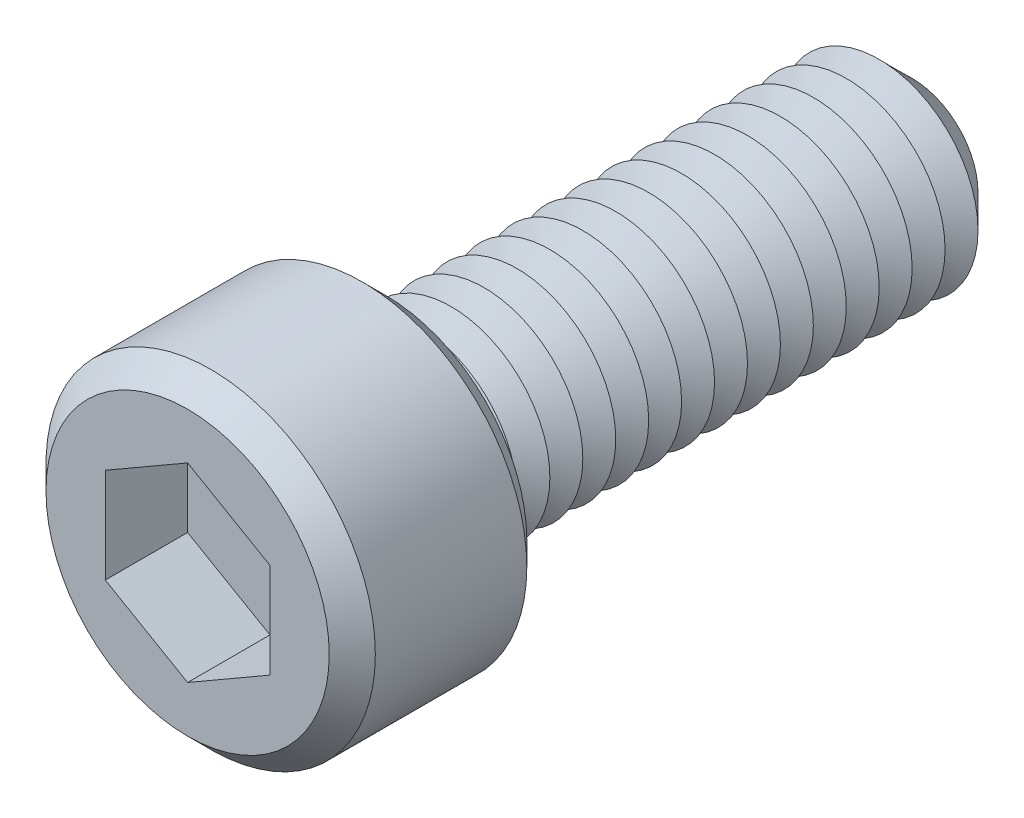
ISO-10303-21;
HEADER;
FILE_DESCRIPTION(('STEP AP214'),'2;1');
FILE_NAME('part.step','',(''),(''),'','','');
FILE_SCHEMA(('AUTOMOTIVE_DESIGN { 1 0 10303 214 1 1 1 1 }'));
ENDSEC;
DATA;
#1=APPLICATION_CONTEXT('core data for automotive mechanical design processes');
#2=APPLICATION_PROTOCOL_DEFINITION('international standard','automotive_design',2000,#1);
#3=PRODUCT_CONTEXT('',#1,'mechanical');
#4=PRODUCT('Part','Part','',(#3));
#5=PRODUCT_RELATED_PRODUCT_CATEGORY('part','',(#4));
#6=PRODUCT_DEFINITION_FORMATION('','',#4);
#7=PRODUCT_DEFINITION_CONTEXT('part definition',#1,'design');
#8=PRODUCT_DEFINITION('design','',#6,#7);
#9=PRODUCT_DEFINITION_SHAPE('','',#8);
#10=(LENGTH_UNIT() NAMED_UNIT(*) SI_UNIT(.MILLI.,.METRE.));
#11=(NAMED_UNIT(*) PLANE_ANGLE_UNIT() SI_UNIT($,.RADIAN.));
#12=(NAMED_UNIT(*) SI_UNIT($,.STERADIAN.) SOLID_ANGLE_UNIT());
#13=UNCERTAINTY_MEASURE_WITH_UNIT(LENGTH_MEASURE(1.E-05),#10,'distance_accuracy_value','');
#14=(GEOMETRIC_REPRESENTATION_CONTEXT(3) GLOBAL_UNCERTAINTY_ASSIGNED_CONTEXT((#13)) GLOBAL_UNIT_ASSIGNED_CONTEXT((#10,
#11,#12)) REPRESENTATION_CONTEXT('',''));
#15=CARTESIAN_POINT('',(0.,0.,0.));
#16=DIRECTION('',(0.,0.,1.));
#17=DIRECTION('',(1.,0.,0.));
#18=AXIS2_PLACEMENT_3D('',#15,#16,#17);
#19=CARTESIAN_POINT('',(0.,0.,6.));
#20=DIRECTION('',(0.,0.,-1.));
#21=DIRECTION('',(-1.,0.,0.));
#22=AXIS2_PLACEMENT_3D('',#19,#20,#21);
#23=CYLINDRICAL_SURFACE('',#22,5.);
#24=CARTESIAN_POINT('',(0.,0.,0.7));
#25=DIRECTION('',(0.,0.,1.));
#26=DIRECTION('',(1.,0.,0.));
#27=AXIS2_PLACEMENT_3D('',#24,#25,#26);
#28=CIRCLE('',#27,5.);
#29=CARTESIAN_POINT('',(5.,0.,0.7));
#30=VERTEX_POINT('',#29);
#31=EDGE_CURVE('E296',#30,#30,#28,.T.);
#32=ORIENTED_EDGE('',*,*,#31,.T.);
#33=EDGE_LOOP('',(#32));
#34=FACE_BOUND('',#33,.T.);
#35=CARTESIAN_POINT('',(0.,0.,5.3));
#36=DIRECTION('',(0.,0.,1.));
#37=DIRECTION('',(1.,0.,0.));
#38=AXIS2_PLACEMENT_3D('',#35,#36,#37);
#39=CIRCLE('',#38,5.);
#40=CARTESIAN_POINT('',(5.,0.,5.3));
#41=VERTEX_POINT('',#40);
#42=EDGE_CURVE('E292',#41,#41,#39,.F.);
#43=ORIENTED_EDGE('',*,*,#42,.T.);
#44=EDGE_LOOP('',(#43));
#45=FACE_BOUND('',#44,.T.);
#46=ADVANCED_FACE('F39',(#34,#45),#23,.T.);
#47=CARTESIAN_POINT('',(0.,0.,6.));
#48=DIRECTION('',(0.,0.,1.));
#49=DIRECTION('',(1.,0.,0.));
#50=AXIS2_PLACEMENT_3D('',#47,#48,#49);
#51=PLANE('',#50);
#52=CARTESIAN_POINT('',(0.,0.,6.));
#53=DIRECTION('',(0.,0.,1.));
#54=DIRECTION('',(1.,0.,0.));
#55=AXIS2_PLACEMENT_3D('',#52,#53,#54);
#56=CIRCLE('',#55,4.30000000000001);
#57=CARTESIAN_POINT('',(4.30000000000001,0.,6.));
#58=VERTEX_POINT('',#57);
#59=EDGE_CURVE('E11',#58,#58,#56,.T.);
#60=ORIENTED_EDGE('',*,*,#59,.T.);
#61=EDGE_LOOP('',(#60));
#62=FACE_BOUND('',#61,.T.);
#63=DIRECTION('',(-0.866025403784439,0.5,0.));
#64=VECTOR('',#63,1.);
#65=CARTESIAN_POINT('',(2.5,1.44337567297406,6.));
#66=LINE('',#65,#64);
#67=CARTESIAN_POINT('',(2.5,1.44337567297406,6.));
#68=VERTEX_POINT('',#67);
#69=CARTESIAN_POINT('',(0.,2.88675134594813,6.));
#70=VERTEX_POINT('',#69);
#71=EDGE_CURVE('E55',#68,#70,#66,.T.);
#72=ORIENTED_EDGE('',*,*,#71,.F.);
#73=DIRECTION('',(0.,1.,0.));
#74=VECTOR('',#73,1.);
#75=CARTESIAN_POINT('',(2.5,-1.44337567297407,6.));
#76=LINE('',#75,#74);
#77=CARTESIAN_POINT('',(2.5,-1.44337567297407,6.));
#78=VERTEX_POINT('',#77);
#79=EDGE_CURVE('E151',#78,#68,#76,.T.);
#80=ORIENTED_EDGE('',*,*,#79,.F.);
#81=DIRECTION('',(0.866025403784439,0.5,0.));
#82=VECTOR('',#81,1.);
#83=CARTESIAN_POINT('',(0.,-2.88675134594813,6.));
#84=LINE('',#83,#82);
#85=CARTESIAN_POINT('',(0.,-2.88675134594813,6.));
#86=VERTEX_POINT('',#85);
#87=EDGE_CURVE('E148',#86,#78,#84,.T.);
#88=ORIENTED_EDGE('',*,*,#87,.F.);
#89=DIRECTION('',(0.866025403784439,-0.5,0.));
#90=VECTOR('',#89,1.);
#91=CARTESIAN_POINT('',(-2.5,-1.44337567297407,6.));
#92=LINE('',#91,#90);
#93=CARTESIAN_POINT('',(-2.5,-1.44337567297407,6.));
#94=VERTEX_POINT('',#93);
#95=EDGE_CURVE('E103',#94,#86,#92,.T.);
#96=ORIENTED_EDGE('',*,*,#95,.F.);
#97=DIRECTION('',(0.,-1.,0.));
#98=VECTOR('',#97,1.);
#99=CARTESIAN_POINT('',(-2.5,1.44337567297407,6.));
#100=LINE('',#99,#98);
#101=CARTESIAN_POINT('',(-2.5,1.44337567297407,6.));
#102=VERTEX_POINT('',#101);
#103=EDGE_CURVE('E142',#102,#94,#100,.T.);
#104=ORIENTED_EDGE('',*,*,#103,.F.);
#105=DIRECTION('',(-0.866025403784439,-0.5,0.));
#106=VECTOR('',#105,1.);
#107=CARTESIAN_POINT('',(0.,2.88675134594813,6.));
#108=LINE('',#107,#106);
#109=EDGE_CURVE('E137',#70,#102,#108,.T.);
#110=ORIENTED_EDGE('',*,*,#109,.F.);
#111=EDGE_LOOP('',(#72,#80,#88,#96,#104,#110));
#112=FACE_BOUND('',#111,.T.);
#113=ADVANCED_FACE('F314',(#62,#112),#51,.T.);
#114=CARTESIAN_POINT('',(0.,0.,0.));
#115=DIRECTION('',(0.,0.,1.));
#116=DIRECTION('',(1.,0.,0.));
#117=AXIS2_PLACEMENT_3D('',#114,#115,#116);
#118=PLANE('',#117);
#119=CARTESIAN_POINT('',(0.,0.,0.));
#120=DIRECTION('',(0.,0.,1.));
#121=DIRECTION('',(1.,0.,0.));
#122=AXIS2_PLACEMENT_3D('',#119,#120,#121);
#123=CIRCLE('',#122,4.29999999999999);
#124=CARTESIAN_POINT('',(4.29999999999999,0.,0.));
#125=VERTEX_POINT('',#124);
#126=EDGE_CURVE('E48',#125,#125,#123,.F.);
#127=ORIENTED_EDGE('',*,*,#126,.T.);
#128=EDGE_LOOP('',(#127));
#129=FACE_BOUND('',#128,.T.);
#130=CARTESIAN_POINT('',(0.,0.,0.));
#131=DIRECTION('',(0.,0.,1.));
#132=DIRECTION('',(1.,0.,0.));
#133=AXIS2_PLACEMENT_3D('',#130,#131,#132);
#134=CIRCLE('',#133,3.);
#135=CARTESIAN_POINT('',(3.,0.,0.));
#136=VERTEX_POINT('',#135);
#137=EDGE_CURVE('E284',#136,#136,#134,.T.);
#138=ORIENTED_EDGE('',*,*,#137,.T.);
#139=EDGE_LOOP('',(#138));
#140=FACE_BOUND('',#139,.T.);
#141=ADVANCED_FACE('F303',(#129,#140),#118,.F.);
#142=CARTESIAN_POINT('',(0.,0.,0.));
#143=DIRECTION('',(0.,0.,1.));
#144=DIRECTION('',(1.,0.,0.));
#145=AXIS2_PLACEMENT_3D('',#142,#143,#144);
#146=CONICAL_SURFACE('',#145,3.,1.0471975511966);
#147=CARTESIAN_POINT('',(0.,0.,-0.500000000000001));
#148=DIRECTION('',(0.,0.,1.));
#149=DIRECTION('',(1.,0.,0.));
#150=AXIS2_PLACEMENT_3D('',#147,#148,#149);
#151=CIRCLE('',#150,2.13397459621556);
#152=CARTESIAN_POINT('',(2.13397459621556,0.,-0.500000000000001));
#153=VERTEX_POINT('',#152);
#154=EDGE_CURVE('E280',#153,#153,#151,.T.);
#155=ORIENTED_EDGE('',*,*,#154,.T.);
#156=EDGE_LOOP('',(#155));
#157=FACE_BOUND('',#156,.T.);
#158=ORIENTED_EDGE('',*,*,#137,.F.);
#159=EDGE_LOOP('',(#158));
#160=FACE_BOUND('',#159,.T.);
#161=ADVANCED_FACE('F484',(#157,#160),#146,.T.);
#162=CARTESIAN_POINT('',(0.,0.,-0.500000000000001));
#163=DIRECTION('',(0.,0.,-1.));
#164=DIRECTION('',(-1.,0.,0.));
#165=AXIS2_PLACEMENT_3D('',#162,#163,#164);
#166=CONICAL_SURFACE('',#165,2.13397459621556,1.0471975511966);
#167=CARTESIAN_POINT('',(0.,0.,-1.));
#168=DIRECTION('',(0.,0.,1.));
#169=DIRECTION('',(1.,0.,0.));
#170=AXIS2_PLACEMENT_3D('',#167,#168,#169);
#171=CIRCLE('',#170,3.);
#172=CARTESIAN_POINT('',(3.,0.,-1.));
#173=VERTEX_POINT('',#172);
#174=EDGE_CURVE('E276',#173,#173,#171,.T.);
#175=ORIENTED_EDGE('',*,*,#174,.T.);
#176=EDGE_LOOP('',(#175));
#177=FACE_BOUND('',#176,.T.);
#178=ORIENTED_EDGE('',*,*,#154,.F.);
#179=EDGE_LOOP('',(#178));
#180=FACE_BOUND('',#179,.T.);
#181=ADVANCED_FACE('F480',(#177,#180),#166,.T.);
#182=CARTESIAN_POINT('',(0.,0.,-1.));
#183=DIRECTION('',(0.,0.,1.));
#184=DIRECTION('',(1.,0.,0.));
#185=AXIS2_PLACEMENT_3D('',#182,#183,#184);
#186=CONICAL_SURFACE('',#185,3.,1.0471975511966);
#187=CARTESIAN_POINT('',(0.,0.,-1.5));
#188=DIRECTION('',(0.,0.,1.));
#189=DIRECTION('',(1.,0.,0.));
#190=AXIS2_PLACEMENT_3D('',#187,#188,#189);
#191=CIRCLE('',#190,2.13397459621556);
#192=CARTESIAN_POINT('',(2.13397459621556,0.,-1.5));
#193=VERTEX_POINT('',#192);
#194=EDGE_CURVE('E272',#193,#193,#191,.T.);
#195=ORIENTED_EDGE('',*,*,#194,.T.);
#196=EDGE_LOOP('',(#195));
#197=FACE_BOUND('',#196,.T.);
#198=ORIENTED_EDGE('',*,*,#174,.F.);
#199=EDGE_LOOP('',(#198));
#200=FACE_BOUND('',#199,.T.);
#201=ADVANCED_FACE('F476',(#197,#200),#186,.T.);
#202=CARTESIAN_POINT('',(0.,0.,-1.5));
#203=DIRECTION('',(0.,0.,-1.));
#204=DIRECTION('',(-1.,0.,0.));
#205=AXIS2_PLACEMENT_3D('',#202,#203,#204);
#206=CONICAL_SURFACE('',#205,2.13397459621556,1.0471975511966);
#207=CARTESIAN_POINT('',(0.,0.,-2.));
#208=DIRECTION('',(0.,0.,1.));
#209=DIRECTION('',(1.,0.,0.));
#210=AXIS2_PLACEMENT_3D('',#207,#208,#209);
#211=CIRCLE('',#210,3.);
#212=CARTESIAN_POINT('',(3.,0.,-2.));
#213=VERTEX_POINT('',#212);
#214=EDGE_CURVE('E268',#213,#213,#211,.T.);
#215=ORIENTED_EDGE('',*,*,#214,.T.);
#216=EDGE_LOOP('',(#215));
#217=FACE_BOUND('',#216,.T.);
#218=ORIENTED_EDGE('',*,*,#194,.F.);
#219=EDGE_LOOP('',(#218));
#220=FACE_BOUND('',#219,.T.);
#221=ADVANCED_FACE('F472',(#217,#220),#206,.T.);
#222=CARTESIAN_POINT('',(0.,0.,-2.));
#223=DIRECTION('',(0.,0.,1.));
#224=DIRECTION('',(1.,0.,0.));
#225=AXIS2_PLACEMENT_3D('',#222,#223,#224);
#226=CONICAL_SURFACE('',#225,3.,1.0471975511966);
#227=CARTESIAN_POINT('',(0.,0.,-2.5));
#228=DIRECTION('',(0.,0.,1.));
#229=DIRECTION('',(1.,0.,0.));
#230=AXIS2_PLACEMENT_3D('',#227,#228,#229);
#231=CIRCLE('',#230,2.13397459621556);
#232=CARTESIAN_POINT('',(2.13397459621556,0.,-2.5));
#233=VERTEX_POINT('',#232);
#234=EDGE_CURVE('E264',#233,#233,#231,.T.);
#235=ORIENTED_EDGE('',*,*,#234,.T.);
#236=EDGE_LOOP('',(#235));
#237=FACE_BOUND('',#236,.T.);
#238=ORIENTED_EDGE('',*,*,#214,.F.);
#239=EDGE_LOOP('',(#238));
#240=FACE_BOUND('',#239,.T.);
#241=ADVANCED_FACE('F468',(#237,#240),#226,.T.);
#242=CARTESIAN_POINT('',(0.,0.,-2.5));
#243=DIRECTION('',(0.,0.,-1.));
#244=DIRECTION('',(-1.,0.,0.));
#245=AXIS2_PLACEMENT_3D('',#242,#243,#244);
#246=CONICAL_SURFACE('',#245,2.13397459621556,1.0471975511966);
#247=CARTESIAN_POINT('',(0.,0.,-3.));
#248=DIRECTION('',(0.,0.,1.));
#249=DIRECTION('',(1.,0.,0.));
#250=AXIS2_PLACEMENT_3D('',#247,#248,#249);
#251=CIRCLE('',#250,3.);
#252=CARTESIAN_POINT('',(3.,0.,-3.));
#253=VERTEX_POINT('',#252);
#254=EDGE_CURVE('E260',#253,#253,#251,.T.);
#255=ORIENTED_EDGE('',*,*,#254,.T.);
#256=EDGE_LOOP('',(#255));
#257=FACE_BOUND('',#256,.T.);
#258=ORIENTED_EDGE('',*,*,#234,.F.);
#259=EDGE_LOOP('',(#258));
#260=FACE_BOUND('',#259,.T.);
#261=ADVANCED_FACE('F464',(#257,#260),#246,.T.);
#262=CARTESIAN_POINT('',(0.,0.,-3.));
#263=DIRECTION('',(0.,0.,1.));
#264=DIRECTION('',(1.,0.,0.));
#265=AXIS2_PLACEMENT_3D('',#262,#263,#264);
#266=CONICAL_SURFACE('',#265,3.,1.0471975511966);
#267=CARTESIAN_POINT('',(0.,0.,-3.5));
#268=DIRECTION('',(0.,0.,1.));
#269=DIRECTION('',(1.,0.,0.));
#270=AXIS2_PLACEMENT_3D('',#267,#268,#269);
#271=CIRCLE('',#270,2.13397459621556);
#272=CARTESIAN_POINT('',(2.13397459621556,0.,-3.5));
#273=VERTEX_POINT('',#272);
#274=EDGE_CURVE('E256',#273,#273,#271,.T.);
#275=ORIENTED_EDGE('',*,*,#274,.T.);
#276=EDGE_LOOP('',(#275));
#277=FACE_BOUND('',#276,.T.);
#278=ORIENTED_EDGE('',*,*,#254,.F.);
#279=EDGE_LOOP('',(#278));
#280=FACE_BOUND('',#279,.T.);
#281=ADVANCED_FACE('F460',(#277,#280),#266,.T.);
#282=CARTESIAN_POINT('',(0.,0.,-3.5));
#283=DIRECTION('',(0.,0.,-1.));
#284=DIRECTION('',(-1.,0.,0.));
#285=AXIS2_PLACEMENT_3D('',#282,#283,#284);
#286=CONICAL_SURFACE('',#285,2.13397459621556,1.0471975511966);
#287=CARTESIAN_POINT('',(0.,0.,-4.));
#288=DIRECTION('',(0.,0.,1.));
#289=DIRECTION('',(1.,0.,0.));
#290=AXIS2_PLACEMENT_3D('',#287,#288,#289);
#291=CIRCLE('',#290,3.);
#292=CARTESIAN_POINT('',(3.,0.,-4.));
#293=VERTEX_POINT('',#292);
#294=EDGE_CURVE('E252',#293,#293,#291,.T.);
#295=ORIENTED_EDGE('',*,*,#294,.T.);
#296=EDGE_LOOP('',(#295));
#297=FACE_BOUND('',#296,.T.);
#298=ORIENTED_EDGE('',*,*,#274,.F.);
#299=EDGE_LOOP('',(#298));
#300=FACE_BOUND('',#299,.T.);
#301=ADVANCED_FACE('F456',(#297,#300),#286,.T.);
#302=CARTESIAN_POINT('',(0.,0.,-4.));
#303=DIRECTION('',(0.,0.,1.));
#304=DIRECTION('',(1.,0.,0.));
#305=AXIS2_PLACEMENT_3D('',#302,#303,#304);
#306=CONICAL_SURFACE('',#305,3.,1.0471975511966);
#307=CARTESIAN_POINT('',(0.,0.,-4.5));
#308=DIRECTION('',(0.,0.,1.));
#309=DIRECTION('',(1.,0.,0.));
#310=AXIS2_PLACEMENT_3D('',#307,#308,#309);
#311=CIRCLE('',#310,2.13397459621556);
#312=CARTESIAN_POINT('',(2.13397459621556,0.,-4.5));
#313=VERTEX_POINT('',#312);
#314=EDGE_CURVE('E248',#313,#313,#311,.T.);
#315=ORIENTED_EDGE('',*,*,#314,.T.);
#316=EDGE_LOOP('',(#315));
#317=FACE_BOUND('',#316,.T.);
#318=ORIENTED_EDGE('',*,*,#294,.F.);
#319=EDGE_LOOP('',(#318));
#320=FACE_BOUND('',#319,.T.);
#321=ADVANCED_FACE('F452',(#317,#320),#306,.T.);
#322=CARTESIAN_POINT('',(0.,0.,-4.5));
#323=DIRECTION('',(0.,0.,-1.));
#324=DIRECTION('',(-1.,0.,0.));
#325=AXIS2_PLACEMENT_3D('',#322,#323,#324);
#326=CONICAL_SURFACE('',#325,2.13397459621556,1.0471975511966);
#327=CARTESIAN_POINT('',(0.,0.,-5.));
#328=DIRECTION('',(0.,0.,1.));
#329=DIRECTION('',(1.,0.,0.));
#330=AXIS2_PLACEMENT_3D('',#327,#328,#329);
#331=CIRCLE('',#330,3.);
#332=CARTESIAN_POINT('',(3.,0.,-5.));
#333=VERTEX_POINT('',#332);
#334=EDGE_CURVE('E244',#333,#333,#331,.T.);
#335=ORIENTED_EDGE('',*,*,#334,.T.);
#336=EDGE_LOOP('',(#335));
#337=FACE_BOUND('',#336,.T.);
#338=ORIENTED_EDGE('',*,*,#314,.F.);
#339=EDGE_LOOP('',(#338));
#340=FACE_BOUND('',#339,.T.);
#341=ADVANCED_FACE('F448',(#337,#340),#326,.T.);
#342=CARTESIAN_POINT('',(0.,0.,-5.));
#343=DIRECTION('',(0.,0.,1.));
#344=DIRECTION('',(1.,0.,0.));
#345=AXIS2_PLACEMENT_3D('',#342,#343,#344);
#346=CONICAL_SURFACE('',#345,3.,1.0471975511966);
#347=CARTESIAN_POINT('',(0.,0.,-5.5));
#348=DIRECTION('',(0.,0.,1.));
#349=DIRECTION('',(1.,0.,0.));
#350=AXIS2_PLACEMENT_3D('',#347,#348,#349);
#351=CIRCLE('',#350,2.13397459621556);
#352=CARTESIAN_POINT('',(2.13397459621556,0.,-5.5));
#353=VERTEX_POINT('',#352);
#354=EDGE_CURVE('E240',#353,#353,#351,.T.);
#355=ORIENTED_EDGE('',*,*,#354,.T.);
#356=EDGE_LOOP('',(#355));
#357=FACE_BOUND('',#356,.T.);
#358=ORIENTED_EDGE('',*,*,#334,.F.);
#359=EDGE_LOOP('',(#358));
#360=FACE_BOUND('',#359,.T.);
#361=ADVANCED_FACE('F444',(#357,#360),#346,.T.);
#362=CARTESIAN_POINT('',(0.,0.,-5.5));
#363=DIRECTION('',(0.,0.,-1.));
#364=DIRECTION('',(-1.,0.,0.));
#365=AXIS2_PLACEMENT_3D('',#362,#363,#364);
#366=CONICAL_SURFACE('',#365,2.13397459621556,1.0471975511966);
#367=CARTESIAN_POINT('',(0.,0.,-6.));
#368=DIRECTION('',(0.,0.,1.));
#369=DIRECTION('',(1.,0.,0.));
#370=AXIS2_PLACEMENT_3D('',#367,#368,#369);
#371=CIRCLE('',#370,3.);
#372=CARTESIAN_POINT('',(3.,0.,-6.));
#373=VERTEX_POINT('',#372);
#374=EDGE_CURVE('E236',#373,#373,#371,.T.);
#375=ORIENTED_EDGE('',*,*,#374,.T.);
#376=EDGE_LOOP('',(#375));
#377=FACE_BOUND('',#376,.T.);
#378=ORIENTED_EDGE('',*,*,#354,.F.);
#379=EDGE_LOOP('',(#378));
#380=FACE_BOUND('',#379,.T.);
#381=ADVANCED_FACE('F440',(#377,#380),#366,.T.);
#382=CARTESIAN_POINT('',(0.,0.,-6.));
#383=DIRECTION('',(0.,0.,1.));
#384=DIRECTION('',(1.,0.,0.));
#385=AXIS2_PLACEMENT_3D('',#382,#383,#384);
#386=CONICAL_SURFACE('',#385,3.,1.0471975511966);
#387=CARTESIAN_POINT('',(0.,0.,-6.5));
#388=DIRECTION('',(0.,0.,1.));
#389=DIRECTION('',(1.,0.,0.));
#390=AXIS2_PLACEMENT_3D('',#387,#388,#389);
#391=CIRCLE('',#390,2.13397459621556);
#392=CARTESIAN_POINT('',(2.13397459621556,0.,-6.5));
#393=VERTEX_POINT('',#392);
#394=EDGE_CURVE('E232',#393,#393,#391,.T.);
#395=ORIENTED_EDGE('',*,*,#394,.T.);
#396=EDGE_LOOP('',(#395));
#397=FACE_BOUND('',#396,.T.);
#398=ORIENTED_EDGE('',*,*,#374,.F.);
#399=EDGE_LOOP('',(#398));
#400=FACE_BOUND('',#399,.T.);
#401=ADVANCED_FACE('F436',(#397,#400),#386,.T.);
#402=CARTESIAN_POINT('',(0.,0.,-6.5));
#403=DIRECTION('',(0.,0.,-1.));
#404=DIRECTION('',(-1.,0.,0.));
#405=AXIS2_PLACEMENT_3D('',#402,#403,#404);
#406=CONICAL_SURFACE('',#405,2.13397459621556,1.0471975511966);
#407=CARTESIAN_POINT('',(0.,0.,-7.));
#408=DIRECTION('',(0.,0.,1.));
#409=DIRECTION('',(1.,0.,0.));
#410=AXIS2_PLACEMENT_3D('',#407,#408,#409);
#411=CIRCLE('',#410,3.);
#412=CARTESIAN_POINT('',(3.,0.,-7.));
#413=VERTEX_POINT('',#412);
#414=EDGE_CURVE('E228',#413,#413,#411,.T.);
#415=ORIENTED_EDGE('',*,*,#414,.T.);
#416=EDGE_LOOP('',(#415));
#417=FACE_BOUND('',#416,.T.);
#418=ORIENTED_EDGE('',*,*,#394,.F.);
#419=EDGE_LOOP('',(#418));
#420=FACE_BOUND('',#419,.T.);
#421=ADVANCED_FACE('F432',(#417,#420),#406,.T.);
#422=CARTESIAN_POINT('',(0.,0.,-7.));
#423=DIRECTION('',(0.,0.,1.));
#424=DIRECTION('',(1.,0.,0.));
#425=AXIS2_PLACEMENT_3D('',#422,#423,#424);
#426=CONICAL_SURFACE('',#425,3.,1.0471975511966);
#427=CARTESIAN_POINT('',(0.,0.,-7.5));
#428=DIRECTION('',(0.,0.,1.));
#429=DIRECTION('',(1.,0.,0.));
#430=AXIS2_PLACEMENT_3D('',#427,#428,#429);
#431=CIRCLE('',#430,2.13397459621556);
#432=CARTESIAN_POINT('',(2.13397459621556,0.,-7.5));
#433=VERTEX_POINT('',#432);
#434=EDGE_CURVE('E224',#433,#433,#431,.T.);
#435=ORIENTED_EDGE('',*,*,#434,.T.);
#436=EDGE_LOOP('',(#435));
#437=FACE_BOUND('',#436,.T.);
#438=ORIENTED_EDGE('',*,*,#414,.F.);
#439=EDGE_LOOP('',(#438));
#440=FACE_BOUND('',#439,.T.);
#441=ADVANCED_FACE('F428',(#437,#440),#426,.T.);
#442=CARTESIAN_POINT('',(0.,0.,-7.5));
#443=DIRECTION('',(0.,0.,-1.));
#444=DIRECTION('',(-1.,0.,0.));
#445=AXIS2_PLACEMENT_3D('',#442,#443,#444);
#446=CONICAL_SURFACE('',#445,2.13397459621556,1.0471975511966);
#447=CARTESIAN_POINT('',(0.,0.,-8.));
#448=DIRECTION('',(0.,0.,1.));
#449=DIRECTION('',(1.,0.,0.));
#450=AXIS2_PLACEMENT_3D('',#447,#448,#449);
#451=CIRCLE('',#450,3.);
#452=CARTESIAN_POINT('',(3.,0.,-8.));
#453=VERTEX_POINT('',#452);
#454=EDGE_CURVE('E221',#453,#453,#451,.T.);
#455=ORIENTED_EDGE('',*,*,#454,.T.);
#456=EDGE_LOOP('',(#455));
#457=FACE_BOUND('',#456,.T.);
#458=ORIENTED_EDGE('',*,*,#434,.F.);
#459=EDGE_LOOP('',(#458));
#460=FACE_BOUND('',#459,.T.);
#461=ADVANCED_FACE('F424',(#457,#460),#446,.T.);
#462=CARTESIAN_POINT('',(0.,0.,-8.));
#463=DIRECTION('',(0.,0.,1.));
#464=DIRECTION('',(1.,0.,0.));
#465=AXIS2_PLACEMENT_3D('',#462,#463,#464);
#466=CONICAL_SURFACE('',#465,3.,1.0471975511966);
#467=CARTESIAN_POINT('',(0.,0.,-8.5));
#468=DIRECTION('',(0.,0.,1.));
#469=DIRECTION('',(1.,0.,0.));
#470=AXIS2_PLACEMENT_3D('',#467,#468,#469);
#471=CIRCLE('',#470,2.13397459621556);
#472=CARTESIAN_POINT('',(2.13397459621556,0.,-8.5));
#473=VERTEX_POINT('',#472);
#474=EDGE_CURVE('E217',#473,#473,#471,.T.);
#475=ORIENTED_EDGE('',*,*,#474,.T.);
#476=EDGE_LOOP('',(#475));
#477=FACE_BOUND('',#476,.T.);
#478=ORIENTED_EDGE('',*,*,#454,.F.);
#479=EDGE_LOOP('',(#478));
#480=FACE_BOUND('',#479,.T.);
#481=ADVANCED_FACE('F420',(#477,#480),#466,.T.);
#482=CARTESIAN_POINT('',(0.,0.,-8.5));
#483=DIRECTION('',(0.,0.,-1.));
#484=DIRECTION('',(-1.,0.,0.));
#485=AXIS2_PLACEMENT_3D('',#482,#483,#484);
#486=CONICAL_SURFACE('',#485,2.13397459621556,1.0471975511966);
#487=CARTESIAN_POINT('',(0.,0.,-9.));
#488=DIRECTION('',(0.,0.,1.));
#489=DIRECTION('',(1.,0.,0.));
#490=AXIS2_PLACEMENT_3D('',#487,#488,#489);
#491=CIRCLE('',#490,3.);
#492=CARTESIAN_POINT('',(3.,0.,-9.));
#493=VERTEX_POINT('',#492);
#494=EDGE_CURVE('E213',#493,#493,#491,.T.);
#495=ORIENTED_EDGE('',*,*,#494,.T.);
#496=EDGE_LOOP('',(#495));
#497=FACE_BOUND('',#496,.T.);
#498=ORIENTED_EDGE('',*,*,#474,.F.);
#499=EDGE_LOOP('',(#498));
#500=FACE_BOUND('',#499,.T.);
#501=ADVANCED_FACE('F416',(#497,#500),#486,.T.);
#502=CARTESIAN_POINT('',(0.,0.,-9.));
#503=DIRECTION('',(0.,0.,1.));
#504=DIRECTION('',(1.,0.,0.));
#505=AXIS2_PLACEMENT_3D('',#502,#503,#504);
#506=CONICAL_SURFACE('',#505,3.,1.0471975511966);
#507=CARTESIAN_POINT('',(0.,0.,-9.5));
#508=DIRECTION('',(0.,0.,1.));
#509=DIRECTION('',(1.,0.,0.));
#510=AXIS2_PLACEMENT_3D('',#507,#508,#509);
#511=CIRCLE('',#510,2.13397459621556);
#512=CARTESIAN_POINT('',(2.13397459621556,0.,-9.5));
#513=VERTEX_POINT('',#512);
#514=EDGE_CURVE('E209',#513,#513,#511,.T.);
#515=ORIENTED_EDGE('',*,*,#514,.T.);
#516=EDGE_LOOP('',(#515));
#517=FACE_BOUND('',#516,.T.);
#518=ORIENTED_EDGE('',*,*,#494,.F.);
#519=EDGE_LOOP('',(#518));
#520=FACE_BOUND('',#519,.T.);
#521=ADVANCED_FACE('F412',(#517,#520),#506,.T.);
#522=CARTESIAN_POINT('',(0.,0.,-9.5));
#523=DIRECTION('',(0.,0.,-1.));
#524=DIRECTION('',(-1.,0.,0.));
#525=AXIS2_PLACEMENT_3D('',#522,#523,#524);
#526=CONICAL_SURFACE('',#525,2.13397459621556,1.0471975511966);
#527=CARTESIAN_POINT('',(0.,0.,-10.));
#528=DIRECTION('',(0.,0.,1.));
#529=DIRECTION('',(1.,0.,0.));
#530=AXIS2_PLACEMENT_3D('',#527,#528,#529);
#531=CIRCLE('',#530,3.);
#532=CARTESIAN_POINT('',(3.,0.,-10.));
#533=VERTEX_POINT('',#532);
#534=EDGE_CURVE('E205',#533,#533,#531,.T.);
#535=ORIENTED_EDGE('',*,*,#534,.T.);
#536=EDGE_LOOP('',(#535));
#537=FACE_BOUND('',#536,.T.);
#538=ORIENTED_EDGE('',*,*,#514,.F.);
#539=EDGE_LOOP('',(#538));
#540=FACE_BOUND('',#539,.T.);
#541=ADVANCED_FACE('F408',(#537,#540),#526,.T.);
#542=CARTESIAN_POINT('',(0.,0.,-10.));
#543=DIRECTION('',(0.,0.,1.));
#544=DIRECTION('',(1.,0.,0.));
#545=AXIS2_PLACEMENT_3D('',#542,#543,#544);
#546=CONICAL_SURFACE('',#545,3.,1.0471975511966);
#547=CARTESIAN_POINT('',(0.,0.,-10.5));
#548=DIRECTION('',(0.,0.,1.));
#549=DIRECTION('',(1.,0.,0.));
#550=AXIS2_PLACEMENT_3D('',#547,#548,#549);
#551=CIRCLE('',#550,2.13397459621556);
#552=CARTESIAN_POINT('',(2.13397459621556,0.,-10.5));
#553=VERTEX_POINT('',#552);
#554=EDGE_CURVE('E201',#553,#553,#551,.T.);
#555=ORIENTED_EDGE('',*,*,#554,.T.);
#556=EDGE_LOOP('',(#555));
#557=FACE_BOUND('',#556,.T.);
#558=ORIENTED_EDGE('',*,*,#534,.F.);
#559=EDGE_LOOP('',(#558));
#560=FACE_BOUND('',#559,.T.);
#561=ADVANCED_FACE('F404',(#557,#560),#546,.T.);
#562=CARTESIAN_POINT('',(0.,0.,-10.5));
#563=DIRECTION('',(0.,0.,-1.));
#564=DIRECTION('',(-1.,0.,0.));
#565=AXIS2_PLACEMENT_3D('',#562,#563,#564);
#566=CONICAL_SURFACE('',#565,2.13397459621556,1.0471975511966);
#567=CARTESIAN_POINT('',(0.,0.,-11.));
#568=DIRECTION('',(0.,0.,1.));
#569=DIRECTION('',(1.,0.,0.));
#570=AXIS2_PLACEMENT_3D('',#567,#568,#569);
#571=CIRCLE('',#570,3.);
#572=CARTESIAN_POINT('',(3.,0.,-11.));
#573=VERTEX_POINT('',#572);
#574=EDGE_CURVE('E197',#573,#573,#571,.T.);
#575=ORIENTED_EDGE('',*,*,#574,.T.);
#576=EDGE_LOOP('',(#575));
#577=FACE_BOUND('',#576,.T.);
#578=ORIENTED_EDGE('',*,*,#554,.F.);
#579=EDGE_LOOP('',(#578));
#580=FACE_BOUND('',#579,.T.);
#581=ADVANCED_FACE('F400',(#577,#580),#566,.T.);
#582=CARTESIAN_POINT('',(0.,0.,-11.));
#583=DIRECTION('',(0.,0.,1.));
#584=DIRECTION('',(1.,0.,0.));
#585=AXIS2_PLACEMENT_3D('',#582,#583,#584);
#586=CONICAL_SURFACE('',#585,3.,1.0471975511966);
#587=CARTESIAN_POINT('',(0.,0.,-11.5));
#588=DIRECTION('',(0.,0.,1.));
#589=DIRECTION('',(1.,0.,0.));
#590=AXIS2_PLACEMENT_3D('',#587,#588,#589);
#591=CIRCLE('',#590,2.13397459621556);
#592=CARTESIAN_POINT('',(2.13397459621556,0.,-11.5));
#593=VERTEX_POINT('',#592);
#594=EDGE_CURVE('E193',#593,#593,#591,.T.);
#595=ORIENTED_EDGE('',*,*,#594,.T.);
#596=EDGE_LOOP('',(#595));
#597=FACE_BOUND('',#596,.T.);
#598=ORIENTED_EDGE('',*,*,#574,.F.);
#599=EDGE_LOOP('',(#598));
#600=FACE_BOUND('',#599,.T.);
#601=ADVANCED_FACE('F396',(#597,#600),#586,.T.);
#602=CARTESIAN_POINT('',(0.,0.,-11.5));
#603=DIRECTION('',(0.,0.,-1.));
#604=DIRECTION('',(-1.,0.,0.));
#605=AXIS2_PLACEMENT_3D('',#602,#603,#604);
#606=CONICAL_SURFACE('',#605,2.13397459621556,1.0471975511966);
#607=CARTESIAN_POINT('',(0.,0.,-12.));
#608=DIRECTION('',(0.,0.,1.));
#609=DIRECTION('',(1.,0.,0.));
#610=AXIS2_PLACEMENT_3D('',#607,#608,#609);
#611=CIRCLE('',#610,3.);
#612=CARTESIAN_POINT('',(3.,0.,-12.));
#613=VERTEX_POINT('',#612);
#614=EDGE_CURVE('E189',#613,#613,#611,.T.);
#615=ORIENTED_EDGE('',*,*,#614,.T.);
#616=EDGE_LOOP('',(#615));
#617=FACE_BOUND('',#616,.T.);
#618=ORIENTED_EDGE('',*,*,#594,.F.);
#619=EDGE_LOOP('',(#618));
#620=FACE_BOUND('',#619,.T.);
#621=ADVANCED_FACE('F392',(#617,#620),#606,.T.);
#622=CARTESIAN_POINT('',(0.,0.,-12.));
#623=DIRECTION('',(0.,0.,1.));
#624=DIRECTION('',(1.,0.,0.));
#625=AXIS2_PLACEMENT_3D('',#622,#623,#624);
#626=CONICAL_SURFACE('',#625,3.,1.0471975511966);
#627=CARTESIAN_POINT('',(0.,0.,-12.5));
#628=DIRECTION('',(0.,0.,1.));
#629=DIRECTION('',(1.,0.,0.));
#630=AXIS2_PLACEMENT_3D('',#627,#628,#629);
#631=CIRCLE('',#630,2.13397459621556);
#632=CARTESIAN_POINT('',(2.13397459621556,0.,-12.5));
#633=VERTEX_POINT('',#632);
#634=EDGE_CURVE('E185',#633,#633,#631,.T.);
#635=ORIENTED_EDGE('',*,*,#634,.T.);
#636=EDGE_LOOP('',(#635));
#637=FACE_BOUND('',#636,.T.);
#638=ORIENTED_EDGE('',*,*,#614,.F.);
#639=EDGE_LOOP('',(#638));
#640=FACE_BOUND('',#639,.T.);
#641=ADVANCED_FACE('F388',(#637,#640),#626,.T.);
#642=CARTESIAN_POINT('',(0.,0.,-12.5));
#643=DIRECTION('',(0.,0.,-1.));
#644=DIRECTION('',(-1.,0.,0.));
#645=AXIS2_PLACEMENT_3D('',#642,#643,#644);
#646=CONICAL_SURFACE('',#645,2.13397459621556,1.0471975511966);
#647=CARTESIAN_POINT('',(0.,0.,-13.));
#648=DIRECTION('',(0.,0.,1.));
#649=DIRECTION('',(1.,0.,0.));
#650=AXIS2_PLACEMENT_3D('',#647,#648,#649);
#651=CIRCLE('',#650,3.);
#652=CARTESIAN_POINT('',(3.,0.,-13.));
#653=VERTEX_POINT('',#652);
#654=EDGE_CURVE('E181',#653,#653,#651,.T.);
#655=ORIENTED_EDGE('',*,*,#654,.T.);
#656=EDGE_LOOP('',(#655));
#657=FACE_BOUND('',#656,.T.);
#658=ORIENTED_EDGE('',*,*,#634,.F.);
#659=EDGE_LOOP('',(#658));
#660=FACE_BOUND('',#659,.T.);
#661=ADVANCED_FACE('F384',(#657,#660),#646,.T.);
#662=CARTESIAN_POINT('',(0.,0.,-13.));
#663=DIRECTION('',(0.,0.,1.));
#664=DIRECTION('',(1.,0.,0.));
#665=AXIS2_PLACEMENT_3D('',#662,#663,#664);
#666=CONICAL_SURFACE('',#665,3.,1.0471975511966);
#667=CARTESIAN_POINT('',(0.,0.,-13.5));
#668=DIRECTION('',(0.,0.,1.));
#669=DIRECTION('',(1.,0.,0.));
#670=AXIS2_PLACEMENT_3D('',#667,#668,#669);
#671=CIRCLE('',#670,2.13397459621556);
#672=CARTESIAN_POINT('',(2.13397459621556,0.,-13.5));
#673=VERTEX_POINT('',#672);
#674=EDGE_CURVE('E177',#673,#673,#671,.T.);
#675=ORIENTED_EDGE('',*,*,#674,.T.);
#676=EDGE_LOOP('',(#675));
#677=FACE_BOUND('',#676,.T.);
#678=ORIENTED_EDGE('',*,*,#654,.F.);
#679=EDGE_LOOP('',(#678));
#680=FACE_BOUND('',#679,.T.);
#681=ADVANCED_FACE('F380',(#677,#680),#666,.T.);
#682=CARTESIAN_POINT('',(0.,0.,-13.5));
#683=DIRECTION('',(0.,0.,-1.));
#684=DIRECTION('',(-1.,0.,0.));
#685=AXIS2_PLACEMENT_3D('',#682,#683,#684);
#686=CONICAL_SURFACE('',#685,2.13397459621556,1.0471975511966);
#687=CARTESIAN_POINT('',(0.,0.,-14.));
#688=DIRECTION('',(0.,0.,1.));
#689=DIRECTION('',(1.,0.,0.));
#690=AXIS2_PLACEMENT_3D('',#687,#688,#689);
#691=CIRCLE('',#690,3.);
#692=CARTESIAN_POINT('',(3.,0.,-14.));
#693=VERTEX_POINT('',#692);
#694=EDGE_CURVE('E173',#693,#693,#691,.T.);
#695=ORIENTED_EDGE('',*,*,#694,.T.);
#696=EDGE_LOOP('',(#695));
#697=FACE_BOUND('',#696,.T.);
#698=ORIENTED_EDGE('',*,*,#674,.F.);
#699=EDGE_LOOP('',(#698));
#700=FACE_BOUND('',#699,.T.);
#701=ADVANCED_FACE('F376',(#697,#700),#686,.T.);
#702=CARTESIAN_POINT('',(0.,0.,-14.));
#703=DIRECTION('',(0.,0.,1.));
#704=DIRECTION('',(1.,0.,0.));
#705=AXIS2_PLACEMENT_3D('',#702,#703,#704);
#706=CONICAL_SURFACE('',#705,3.,1.0471975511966);
#707=CARTESIAN_POINT('',(0.,0.,-14.5));
#708=DIRECTION('',(0.,0.,1.));
#709=DIRECTION('',(1.,0.,0.));
#710=AXIS2_PLACEMENT_3D('',#707,#708,#709);
#711=CIRCLE('',#710,2.13397459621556);
#712=CARTESIAN_POINT('',(2.13397459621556,0.,-14.5));
#713=VERTEX_POINT('',#712);
#714=EDGE_CURVE('E169',#713,#713,#711,.T.);
#715=ORIENTED_EDGE('',*,*,#714,.T.);
#716=EDGE_LOOP('',(#715));
#717=FACE_BOUND('',#716,.T.);
#718=ORIENTED_EDGE('',*,*,#694,.F.);
#719=EDGE_LOOP('',(#718));
#720=FACE_BOUND('',#719,.T.);
#721=ADVANCED_FACE('F372',(#717,#720),#706,.T.);
#722=CARTESIAN_POINT('',(0.,0.,-14.5));
#723=DIRECTION('',(0.,0.,-1.));
#724=DIRECTION('',(-1.,0.,0.));
#725=AXIS2_PLACEMENT_3D('',#722,#723,#724);
#726=CONICAL_SURFACE('',#725,2.13397459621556,1.0471975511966);
#727=CARTESIAN_POINT('',(0.,0.,-15.));
#728=DIRECTION('',(0.,0.,1.));
#729=DIRECTION('',(1.,0.,0.));
#730=AXIS2_PLACEMENT_3D('',#727,#728,#729);
#731=CIRCLE('',#730,3.);
#732=CARTESIAN_POINT('',(3.,0.,-15.));
#733=VERTEX_POINT('',#732);
#734=EDGE_CURVE('E157',#733,#733,#731,.T.);
#735=ORIENTED_EDGE('',*,*,#734,.T.);
#736=EDGE_LOOP('',(#735));
#737=FACE_BOUND('',#736,.T.);
#738=ORIENTED_EDGE('',*,*,#714,.F.);
#739=EDGE_LOOP('',(#738));
#740=FACE_BOUND('',#739,.T.);
#741=ADVANCED_FACE('F368',(#737,#740),#726,.T.);
#742=CARTESIAN_POINT('',(0.,0.,-16.));
#743=DIRECTION('',(0.,0.,-1.));
#744=DIRECTION('',(-1.,0.,0.));
#745=AXIS2_PLACEMENT_3D('',#742,#743,#744);
#746=PLANE('',#745);
#747=CARTESIAN_POINT('',(0.,0.,-16.));
#748=DIRECTION('',(0.,0.,-1.));
#749=DIRECTION('',(-1.,0.,0.));
#750=AXIS2_PLACEMENT_3D('',#747,#748,#749);
#751=CIRCLE('',#750,0.8);
#752=CARTESIAN_POINT('',(-0.8,0.,-16.));
#753=VERTEX_POINT('',#752);
#754=EDGE_CURVE('E138',#753,#753,#751,.F.);
#755=ORIENTED_EDGE('',*,*,#754,.T.);
#756=EDGE_LOOP('',(#755));
#757=FACE_BOUND('',#756,.T.);
#758=CARTESIAN_POINT('',(0.,0.,-16.));
#759=DIRECTION('',(0.,0.,-1.));
#760=DIRECTION('',(-1.,0.,0.));
#761=AXIS2_PLACEMENT_3D('',#758,#759,#760);
#762=CIRCLE('',#761,2.);
#763=CARTESIAN_POINT('',(-2.,0.,-16.));
#764=VERTEX_POINT('',#763);
#765=EDGE_CURVE('E288',#764,#764,#762,.T.);
#766=ORIENTED_EDGE('',*,*,#765,.T.);
#767=EDGE_LOOP('',(#766));
#768=FACE_BOUND('',#767,.T.);
#769=ADVANCED_FACE('F371',(#757,#768),#746,.T.);
#770=CARTESIAN_POINT('',(0.,0.,-16.));
#771=DIRECTION('',(0.,0.,1.));
#772=DIRECTION('',(1.,0.,0.));
#773=AXIS2_PLACEMENT_3D('',#770,#771,#772);
#774=CONICAL_SURFACE('',#773,2.,0.785398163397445);
#775=ORIENTED_EDGE('',*,*,#734,.F.);
#776=EDGE_LOOP('',(#775));
#777=FACE_BOUND('',#776,.T.);
#778=ORIENTED_EDGE('',*,*,#765,.F.);
#779=EDGE_LOOP('',(#778));
#780=FACE_BOUND('',#779,.T.);
#781=ADVANCED_FACE('F367',(#777,#780),#774,.T.);
#782=CARTESIAN_POINT('',(2.5,1.44337567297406,3.5));
#783=DIRECTION('',(0.5,0.866025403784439,0.));
#784=DIRECTION('',(-0.866025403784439,0.5,0.));
#785=AXIS2_PLACEMENT_3D('',#782,#783,#784);
#786=PLANE('',#785);
#787=ORIENTED_EDGE('',*,*,#71,.T.);
#788=DIRECTION('',(0.,0.,1.));
#789=VECTOR('',#788,1.);
#790=CARTESIAN_POINT('',(0.,2.88675134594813,3.5));
#791=LINE('',#790,#789);
#792=CARTESIAN_POINT('',(0.,2.88675134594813,3.5));
#793=VERTEX_POINT('',#792);
#794=EDGE_CURVE('E85',#793,#70,#791,.T.);
#795=ORIENTED_EDGE('',*,*,#794,.F.);
#796=DIRECTION('',(-0.866025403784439,0.5,0.));
#797=VECTOR('',#796,1.);
#798=CARTESIAN_POINT('',(2.5,1.44337567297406,3.5));
#799=LINE('',#798,#797);
#800=CARTESIAN_POINT('',(2.5,1.44337567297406,3.5));
#801=VERTEX_POINT('',#800);
#802=EDGE_CURVE('E154',#801,#793,#799,.T.);
#803=ORIENTED_EDGE('',*,*,#802,.F.);
#804=DIRECTION('',(0.,0.,1.));
#805=VECTOR('',#804,1.);
#806=CARTESIAN_POINT('',(2.5,1.44337567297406,3.5));
#807=LINE('',#806,#805);
#808=EDGE_CURVE('E63',#801,#68,#807,.T.);
#809=ORIENTED_EDGE('',*,*,#808,.T.);
#810=EDGE_LOOP('',(#787,#795,#803,#809));
#811=FACE_BOUND('',#810,.T.);
#812=ADVANCED_FACE('F357',(#811),#786,.F.);
#813=CARTESIAN_POINT('',(2.5,-1.44337567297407,3.5));
#814=DIRECTION('',(1.,0.,0.));
#815=DIRECTION('',(0.,1.,0.));
#816=AXIS2_PLACEMENT_3D('',#813,#814,#815);
#817=PLANE('',#816);
#818=ORIENTED_EDGE('',*,*,#79,.T.);
#819=ORIENTED_EDGE('',*,*,#808,.F.);
#820=DIRECTION('',(0.,1.,0.));
#821=VECTOR('',#820,1.);
#822=CARTESIAN_POINT('',(2.5,-1.44337567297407,3.5));
#823=LINE('',#822,#821);
#824=CARTESIAN_POINT('',(2.5,-1.44337567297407,3.5));
#825=VERTEX_POINT('',#824);
#826=EDGE_CURVE('E117',#825,#801,#823,.T.);
#827=ORIENTED_EDGE('',*,*,#826,.F.);
#828=DIRECTION('',(0.,0.,1.));
#829=VECTOR('',#828,1.);
#830=CARTESIAN_POINT('',(2.5,-1.44337567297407,3.5));
#831=LINE('',#830,#829);
#832=EDGE_CURVE('E108',#825,#78,#831,.T.);
#833=ORIENTED_EDGE('',*,*,#832,.T.);
#834=EDGE_LOOP('',(#818,#819,#827,#833));
#835=FACE_BOUND('',#834,.T.);
#836=ADVANCED_FACE('F354',(#835),#817,.F.);
#837=CARTESIAN_POINT('',(0.,-2.88675134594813,3.5));
#838=DIRECTION('',(0.5,-0.866025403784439,0.));
#839=DIRECTION('',(0.866025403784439,0.5,0.));
#840=AXIS2_PLACEMENT_3D('',#837,#838,#839);
#841=PLANE('',#840);
#842=ORIENTED_EDGE('',*,*,#87,.T.);
#843=ORIENTED_EDGE('',*,*,#832,.F.);
#844=DIRECTION('',(0.866025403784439,0.5,0.));
#845=VECTOR('',#844,1.);
#846=CARTESIAN_POINT('',(0.,-2.88675134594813,3.5));
#847=LINE('',#846,#845);
#848=CARTESIAN_POINT('',(0.,-2.88675134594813,3.5));
#849=VERTEX_POINT('',#848);
#850=EDGE_CURVE('E112',#849,#825,#847,.T.);
#851=ORIENTED_EDGE('',*,*,#850,.F.);
#852=DIRECTION('',(0.,0.,1.));
#853=VECTOR('',#852,1.);
#854=CARTESIAN_POINT('',(0.,-2.88675134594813,3.5));
#855=LINE('',#854,#853);
#856=EDGE_CURVE('E96',#849,#86,#855,.T.);
#857=ORIENTED_EDGE('',*,*,#856,.T.);
#858=EDGE_LOOP('',(#842,#843,#851,#857));
#859=FACE_BOUND('',#858,.T.);
#860=ADVANCED_FACE('F113',(#859),#841,.F.);
#861=CARTESIAN_POINT('',(-2.5,-1.44337567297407,3.5));
#862=DIRECTION('',(-0.5,-0.866025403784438,0.));
#863=DIRECTION('',(0.866025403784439,-0.5,0.));
#864=AXIS2_PLACEMENT_3D('',#861,#862,#863);
#865=PLANE('',#864);
#866=ORIENTED_EDGE('',*,*,#95,.T.);
#867=ORIENTED_EDGE('',*,*,#856,.F.);
#868=DIRECTION('',(0.866025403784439,-0.5,0.));
#869=VECTOR('',#868,1.);
#870=CARTESIAN_POINT('',(-2.5,-1.44337567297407,3.5));
#871=LINE('',#870,#869);
#872=CARTESIAN_POINT('',(-2.5,-1.44337567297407,3.5));
#873=VERTEX_POINT('',#872);
#874=EDGE_CURVE('E100',#873,#849,#871,.T.);
#875=ORIENTED_EDGE('',*,*,#874,.F.);
#876=DIRECTION('',(0.,0.,1.));
#877=VECTOR('',#876,1.);
#878=CARTESIAN_POINT('',(-2.5,-1.44337567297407,3.5));
#879=LINE('',#878,#877);
#880=EDGE_CURVE('E109',#873,#94,#879,.T.);
#881=ORIENTED_EDGE('',*,*,#880,.T.);
#882=EDGE_LOOP('',(#866,#867,#875,#881));
#883=FACE_BOUND('',#882,.T.);
#884=ADVANCED_FACE('F98',(#883),#865,.F.);
#885=CARTESIAN_POINT('',(-2.5,1.44337567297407,3.5));
#886=DIRECTION('',(-1.,0.,0.));
#887=DIRECTION('',(0.,-1.,0.));
#888=AXIS2_PLACEMENT_3D('',#885,#886,#887);
#889=PLANE('',#888);
#890=ORIENTED_EDGE('',*,*,#103,.T.);
#891=ORIENTED_EDGE('',*,*,#880,.F.);
#892=DIRECTION('',(0.,-1.,0.));
#893=VECTOR('',#892,1.);
#894=CARTESIAN_POINT('',(-2.5,1.44337567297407,3.5));
#895=LINE('',#894,#893);
#896=CARTESIAN_POINT('',(-2.5,1.44337567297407,3.5));
#897=VERTEX_POINT('',#896);
#898=EDGE_CURVE('E123',#897,#873,#895,.T.);
#899=ORIENTED_EDGE('',*,*,#898,.F.);
#900=DIRECTION('',(0.,0.,1.));
#901=VECTOR('',#900,1.);
#902=CARTESIAN_POINT('',(-2.5,1.44337567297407,3.5));
#903=LINE('',#902,#901);
#904=EDGE_CURVE('E161',#897,#102,#903,.T.);
#905=ORIENTED_EDGE('',*,*,#904,.T.);
#906=EDGE_LOOP('',(#890,#891,#899,#905));
#907=FACE_BOUND('',#906,.T.);
#908=ADVANCED_FACE('F351',(#907),#889,.F.);
#909=CARTESIAN_POINT('',(0.,2.88675134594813,3.5));
#910=DIRECTION('',(-0.5,0.866025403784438,0.));
#911=DIRECTION('',(-0.866025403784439,-0.5,0.));
#912=AXIS2_PLACEMENT_3D('',#909,#910,#911);
#913=PLANE('',#912);
#914=ORIENTED_EDGE('',*,*,#109,.T.);
#915=ORIENTED_EDGE('',*,*,#904,.F.);
#916=DIRECTION('',(-0.866025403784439,-0.5,0.));
#917=VECTOR('',#916,1.);
#918=CARTESIAN_POINT('',(0.,2.88675134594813,3.5));
#919=LINE('',#918,#917);
#920=EDGE_CURVE('E129',#793,#897,#919,.T.);
#921=ORIENTED_EDGE('',*,*,#920,.F.);
#922=ORIENTED_EDGE('',*,*,#794,.T.);
#923=EDGE_LOOP('',(#914,#915,#921,#922));
#924=FACE_BOUND('',#923,.T.);
#925=ADVANCED_FACE('F329',(#924),#913,.F.);
#926=CARTESIAN_POINT('',(0.,0.,3.5));
#927=DIRECTION('',(0.,0.,1.));
#928=DIRECTION('',(1.,0.,0.));
#929=AXIS2_PLACEMENT_3D('',#926,#927,#928);
#930=PLANE('',#929);
#931=CARTESIAN_POINT('',(0.,0.,3.5));
#932=DIRECTION('',(0.,0.,1.));
#933=DIRECTION('',(1.,0.,0.));
#934=AXIS2_PLACEMENT_3D('',#931,#932,#933);
#935=CIRCLE('',#934,0.8);
#936=CARTESIAN_POINT('',(0.8,0.,3.5));
#937=VERTEX_POINT('',#936);
#938=EDGE_CURVE('E337',#937,#937,#935,.T.);
#939=ORIENTED_EDGE('',*,*,#938,.F.);
#940=EDGE_LOOP('',(#939));
#941=FACE_BOUND('',#940,.T.);
#942=ORIENTED_EDGE('',*,*,#802,.T.);
#943=ORIENTED_EDGE('',*,*,#920,.T.);
#944=ORIENTED_EDGE('',*,*,#898,.T.);
#945=ORIENTED_EDGE('',*,*,#874,.T.);
#946=ORIENTED_EDGE('',*,*,#850,.T.);
#947=ORIENTED_EDGE('',*,*,#826,.T.);
#948=EDGE_LOOP('',(#942,#943,#944,#945,#946,#947));
#949=FACE_BOUND('',#948,.T.);
#950=ADVANCED_FACE('F120',(#941,#949),#930,.T.);
#951=CARTESIAN_POINT('',(0.,0.,-18.262741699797));
#952=DIRECTION('',(0.,0.,1.));
#953=DIRECTION('',(1.,0.,0.));
#954=AXIS2_PLACEMENT_3D('',#951,#952,#953);
#955=CYLINDRICAL_SURFACE('',#954,0.8);
#956=ORIENTED_EDGE('',*,*,#938,.T.);
#957=EDGE_LOOP('',(#956));
#958=FACE_BOUND('',#957,.T.);
#959=ORIENTED_EDGE('',*,*,#754,.F.);
#960=EDGE_LOOP('',(#959));
#961=FACE_BOUND('',#960,.T.);
#962=ADVANCED_FACE('F309',(#958,#961),#955,.F.);
#963=CARTESIAN_POINT('',(0.,0.,0.7));
#964=DIRECTION('',(0.,0.,1.));
#965=DIRECTION('',(1.,0.,0.));
#966=AXIS2_PLACEMENT_3D('',#963,#964,#965);
#967=CONICAL_SURFACE('',#966,5.,0.785398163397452);
#968=ORIENTED_EDGE('',*,*,#126,.F.);
#969=EDGE_LOOP('',(#968));
#970=FACE_BOUND('',#969,.T.);
#971=ORIENTED_EDGE('',*,*,#31,.F.);
#972=EDGE_LOOP('',(#971));
#973=FACE_BOUND('',#972,.T.);
#974=ADVANCED_FACE('F306',(#970,#973),#967,.T.);
#975=CARTESIAN_POINT('',(0.,0.,6.));
#976=DIRECTION('',(0.,0.,-1.));
#977=DIRECTION('',(-1.,0.,0.));
#978=AXIS2_PLACEMENT_3D('',#975,#976,#977);
#979=CONICAL_SURFACE('',#978,4.30000000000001,0.785398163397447);
#980=ORIENTED_EDGE('',*,*,#42,.F.);
#981=EDGE_LOOP('',(#980));
#982=FACE_BOUND('',#981,.T.);
#983=ORIENTED_EDGE('',*,*,#59,.F.);
#984=EDGE_LOOP('',(#983));
#985=FACE_BOUND('',#984,.T.);
#986=ADVANCED_FACE('F41',(#982,#985),#979,.T.);
#987=CLOSED_SHELL('',(#46,#113,#141,#161,#181,#201,#221,#241,#261,#281,#301,#321,#341,#361,#381,
#401,#421,#441,#461,#481,#501,#521,#541,#561,#581,#601,#621,#641,#661,#681,#701,#721,#741,#769,
#781,#812,#836,#860,#884,#908,#925,#950,#962,#974,#986));
#988=MANIFOLD_SOLID_BREP('B2',#987);
#989=ADVANCED_BREP_SHAPE_REPRESENTATION('',(#18,#988),#14);
#990=SHAPE_DEFINITION_REPRESENTATION(#9,#989);
ENDSEC;
END-ISO-10303-21;
